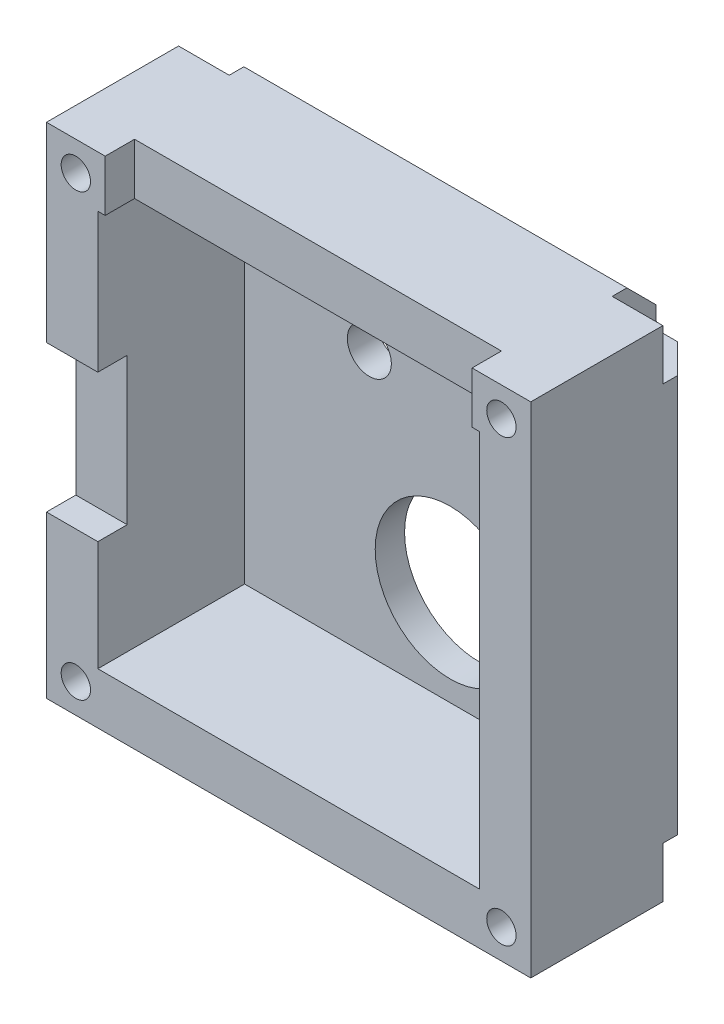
ISO-10303-21;
HEADER;
FILE_DESCRIPTION(('STEP AP214'),'2;1');
FILE_NAME('part.step','',(''),(''),'','','');
FILE_SCHEMA(('AUTOMOTIVE_DESIGN { 1 0 10303 214 1 1 1 1 }'));
ENDSEC;
DATA;
#1=APPLICATION_CONTEXT('core data for automotive mechanical design processes');
#2=APPLICATION_PROTOCOL_DEFINITION('international standard','automotive_design',2000,#1);
#3=PRODUCT_CONTEXT('',#1,'mechanical');
#4=PRODUCT('Part','Part','',(#3));
#5=PRODUCT_RELATED_PRODUCT_CATEGORY('part','',(#4));
#6=PRODUCT_DEFINITION_FORMATION('','',#4);
#7=PRODUCT_DEFINITION_CONTEXT('part definition',#1,'design');
#8=PRODUCT_DEFINITION('design','',#6,#7);
#9=PRODUCT_DEFINITION_SHAPE('','',#8);
#10=(LENGTH_UNIT() NAMED_UNIT(*) SI_UNIT(.MILLI.,.METRE.));
#11=(NAMED_UNIT(*) PLANE_ANGLE_UNIT() SI_UNIT($,.RADIAN.));
#12=(NAMED_UNIT(*) SI_UNIT($,.STERADIAN.) SOLID_ANGLE_UNIT());
#13=UNCERTAINTY_MEASURE_WITH_UNIT(LENGTH_MEASURE(1.E-05),#10,'distance_accuracy_value','');
#14=(GEOMETRIC_REPRESENTATION_CONTEXT(3) GLOBAL_UNCERTAINTY_ASSIGNED_CONTEXT((#13)) GLOBAL_UNIT_ASSIGNED_CONTEXT((#10,
#11,#12)) REPRESENTATION_CONTEXT('',''));
#15=CARTESIAN_POINT('',(0.,0.,0.));
#16=DIRECTION('',(0.,0.,1.));
#17=DIRECTION('',(1.,0.,0.));
#18=AXIS2_PLACEMENT_3D('',#15,#16,#17);
#19=CARTESIAN_POINT('',(0.,0.,10.));
#20=DIRECTION('',(0.,0.,-1.));
#21=DIRECTION('',(-1.,0.,0.));
#22=AXIS2_PLACEMENT_3D('',#19,#20,#21);
#23=PLANE('',#22);
#24=CARTESIAN_POINT('',(14.5,15.,10.));
#25=DIRECTION('',(0.,0.,-1.));
#26=DIRECTION('',(-1.,0.,0.));
#27=AXIS2_PLACEMENT_3D('',#24,#25,#26);
#28=CIRCLE('',#27,0.999999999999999);
#29=CARTESIAN_POINT('',(13.5,15.,10.));
#30=VERTEX_POINT('',#29);
#31=EDGE_CURVE('E457',#30,#30,#28,.T.);
#32=ORIENTED_EDGE('',*,*,#31,.T.);
#33=EDGE_LOOP('',(#32));
#34=FACE_BOUND('',#33,.T.);
#35=CARTESIAN_POINT('',(-14.5,-15.,10.));
#36=DIRECTION('',(0.,0.,-1.));
#37=DIRECTION('',(-1.,0.,0.));
#38=AXIS2_PLACEMENT_3D('',#35,#36,#37);
#39=CIRCLE('',#38,0.999999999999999);
#40=CARTESIAN_POINT('',(-15.5,-15.,10.));
#41=VERTEX_POINT('',#40);
#42=EDGE_CURVE('E466',#41,#41,#39,.T.);
#43=ORIENTED_EDGE('',*,*,#42,.T.);
#44=EDGE_LOOP('',(#43));
#45=FACE_BOUND('',#44,.T.);
#46=CARTESIAN_POINT('',(14.5,-15.,10.));
#47=DIRECTION('',(0.,0.,-1.));
#48=DIRECTION('',(-1.,0.,0.));
#49=AXIS2_PLACEMENT_3D('',#46,#47,#48);
#50=CIRCLE('',#49,0.999999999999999);
#51=CARTESIAN_POINT('',(13.5,-15.,10.));
#52=VERTEX_POINT('',#51);
#53=EDGE_CURVE('E470',#52,#52,#50,.T.);
#54=ORIENTED_EDGE('',*,*,#53,.T.);
#55=EDGE_LOOP('',(#54));
#56=FACE_BOUND('',#55,.T.);
#57=DIRECTION('',(0.,-1.,0.));
#58=VECTOR('',#57,1.);
#59=CARTESIAN_POINT('',(-13.,-13.5,10.));
#60=LINE('',#59,#58);
#61=CARTESIAN_POINT('',(-13.,-6.,10.));
#62=VERTEX_POINT('',#61);
#63=CARTESIAN_POINT('',(-13.,-13.5,10.));
#64=VERTEX_POINT('',#63);
#65=EDGE_CURVE('E484',#62,#64,#60,.T.);
#66=ORIENTED_EDGE('',*,*,#65,.F.);
#67=DIRECTION('',(-1.,0.,0.));
#68=VECTOR('',#67,1.);
#69=CARTESIAN_POINT('',(0.,-6.,10.));
#70=LINE('',#69,#68);
#71=CARTESIAN_POINT('',(-16.5,-6.,10.));
#72=VERTEX_POINT('',#71);
#73=EDGE_CURVE('E313',#62,#72,#70,.T.);
#74=ORIENTED_EDGE('',*,*,#73,.T.);
#75=DIRECTION('',(0.,-1.,0.));
#76=VECTOR('',#75,1.);
#77=CARTESIAN_POINT('',(-16.5,-17.,10.));
#78=LINE('',#77,#76);
#79=CARTESIAN_POINT('',(-16.5,-17.,10.));
#80=VERTEX_POINT('',#79);
#81=EDGE_CURVE('E530',#72,#80,#78,.T.);
#82=ORIENTED_EDGE('',*,*,#81,.T.);
#83=DIRECTION('',(1.,0.,0.));
#84=VECTOR('',#83,1.);
#85=CARTESIAN_POINT('',(-16.5,-17.,10.));
#86=LINE('',#85,#84);
#87=CARTESIAN_POINT('',(16.5,-17.,10.));
#88=VERTEX_POINT('',#87);
#89=EDGE_CURVE('E534',#80,#88,#86,.T.);
#90=ORIENTED_EDGE('',*,*,#89,.T.);
#91=DIRECTION('',(0.,1.,0.));
#92=VECTOR('',#91,1.);
#93=CARTESIAN_POINT('',(16.5,-17.,10.));
#94=LINE('',#93,#92);
#95=CARTESIAN_POINT('',(16.5,17.,10.));
#96=VERTEX_POINT('',#95);
#97=EDGE_CURVE('E521',#88,#96,#94,.T.);
#98=ORIENTED_EDGE('',*,*,#97,.T.);
#99=DIRECTION('',(-1.,0.,0.));
#100=VECTOR('',#99,1.);
#101=CARTESIAN_POINT('',(-16.5,17.,10.));
#102=LINE('',#101,#100);
#103=CARTESIAN_POINT('',(12.5,17.,10.));
#104=VERTEX_POINT('',#103);
#105=EDGE_CURVE('E526',#96,#104,#102,.T.);
#106=ORIENTED_EDGE('',*,*,#105,.T.);
#107=DIRECTION('',(0.,-1.,0.));
#108=VECTOR('',#107,1.);
#109=CARTESIAN_POINT('',(12.5,0.,10.));
#110=LINE('',#109,#108);
#111=CARTESIAN_POINT('',(12.5,13.5,10.));
#112=VERTEX_POINT('',#111);
#113=EDGE_CURVE('E336',#104,#112,#110,.T.);
#114=ORIENTED_EDGE('',*,*,#113,.T.);
#115=DIRECTION('',(-1.,0.,0.));
#116=VECTOR('',#115,1.);
#117=CARTESIAN_POINT('',(-13.,13.5,10.));
#118=LINE('',#117,#116);
#119=CARTESIAN_POINT('',(13.,13.5,10.));
#120=VERTEX_POINT('',#119);
#121=EDGE_CURVE('E480',#120,#112,#118,.T.);
#122=ORIENTED_EDGE('',*,*,#121,.F.);
#123=DIRECTION('',(0.,1.,0.));
#124=VECTOR('',#123,1.);
#125=CARTESIAN_POINT('',(13.,-13.5,10.));
#126=LINE('',#125,#124);
#127=CARTESIAN_POINT('',(13.,-13.5,10.));
#128=VERTEX_POINT('',#127);
#129=EDGE_CURVE('E475',#128,#120,#126,.T.);
#130=ORIENTED_EDGE('',*,*,#129,.F.);
#131=DIRECTION('',(1.,0.,0.));
#132=VECTOR('',#131,1.);
#133=CARTESIAN_POINT('',(-13.,-13.5,10.));
#134=LINE('',#133,#132);
#135=EDGE_CURVE('E489',#64,#128,#134,.T.);
#136=ORIENTED_EDGE('',*,*,#135,.F.);
#137=EDGE_LOOP('',(#66,#74,#82,#90,#98,#106,#114,#122,#130,#136));
#138=FACE_BOUND('',#137,.T.);
#139=ADVANCED_FACE('F47',(#34,#45,#56,#138),#23,.F.);
#140=CARTESIAN_POINT('',(14.5,15.,19.));
#141=DIRECTION('',(0.,0.,-1.));
#142=DIRECTION('',(-1.,0.,0.));
#143=AXIS2_PLACEMENT_3D('',#140,#141,#142);
#144=CYLINDRICAL_SURFACE('',#143,0.999999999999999);
#145=ORIENTED_EDGE('',*,*,#31,.F.);
#146=EDGE_LOOP('',(#145));
#147=FACE_BOUND('',#146,.T.);
#148=CARTESIAN_POINT('',(14.5,15.,1.));
#149=DIRECTION('',(0.,0.,-1.));
#150=DIRECTION('',(-1.,0.,0.));
#151=AXIS2_PLACEMENT_3D('',#148,#149,#150);
#152=CIRCLE('',#151,0.999999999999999);
#153=CARTESIAN_POINT('',(13.5,15.,1.));
#154=VERTEX_POINT('',#153);
#155=EDGE_CURVE('E462',#154,#154,#152,.F.);
#156=ORIENTED_EDGE('',*,*,#155,.F.);
#157=EDGE_LOOP('',(#156));
#158=FACE_BOUND('',#157,.T.);
#159=ADVANCED_FACE('F787',(#147,#158),#144,.F.);
#160=CARTESIAN_POINT('',(-14.5,15.,19.));
#161=DIRECTION('',(0.,0.,-1.));
#162=DIRECTION('',(-1.,0.,0.));
#163=AXIS2_PLACEMENT_3D('',#160,#161,#162);
#164=CYLINDRICAL_SURFACE('',#163,0.999999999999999);
#165=CARTESIAN_POINT('',(-14.5,15.,10.));
#166=DIRECTION('',(0.,0.,-1.));
#167=DIRECTION('',(-1.,0.,0.));
#168=AXIS2_PLACEMENT_3D('',#165,#166,#167);
#169=CIRCLE('',#168,0.999999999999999);
#170=CARTESIAN_POINT('',(-15.5,15.,10.));
#171=VERTEX_POINT('',#170);
#172=EDGE_CURVE('E461',#171,#171,#169,.T.);
#173=ORIENTED_EDGE('',*,*,#172,.F.);
#174=EDGE_LOOP('',(#173));
#175=FACE_BOUND('',#174,.T.);
#176=CARTESIAN_POINT('',(-14.5,15.,1.));
#177=DIRECTION('',(0.,0.,-1.));
#178=DIRECTION('',(-1.,0.,0.));
#179=AXIS2_PLACEMENT_3D('',#176,#177,#178);
#180=CIRCLE('',#179,0.999999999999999);
#181=CARTESIAN_POINT('',(-15.5,15.,1.));
#182=VERTEX_POINT('',#181);
#183=EDGE_CURVE('E561',#182,#182,#180,.F.);
#184=ORIENTED_EDGE('',*,*,#183,.F.);
#185=EDGE_LOOP('',(#184));
#186=FACE_BOUND('',#185,.T.);
#187=ADVANCED_FACE('F795',(#175,#186),#164,.F.);
#188=CARTESIAN_POINT('',(-14.5,-15.,19.));
#189=DIRECTION('',(0.,0.,-1.));
#190=DIRECTION('',(-1.,0.,0.));
#191=AXIS2_PLACEMENT_3D('',#188,#189,#190);
#192=CYLINDRICAL_SURFACE('',#191,0.999999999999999);
#193=ORIENTED_EDGE('',*,*,#42,.F.);
#194=EDGE_LOOP('',(#193));
#195=FACE_BOUND('',#194,.T.);
#196=CARTESIAN_POINT('',(-14.5,-15.,1.));
#197=DIRECTION('',(0.,0.,-1.));
#198=DIRECTION('',(-1.,0.,0.));
#199=AXIS2_PLACEMENT_3D('',#196,#197,#198);
#200=CIRCLE('',#199,0.999999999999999);
#201=CARTESIAN_POINT('',(-15.5,-15.,1.));
#202=VERTEX_POINT('',#201);
#203=EDGE_CURVE('E557',#202,#202,#200,.F.);
#204=ORIENTED_EDGE('',*,*,#203,.F.);
#205=EDGE_LOOP('',(#204));
#206=FACE_BOUND('',#205,.T.);
#207=ADVANCED_FACE('F811',(#195,#206),#192,.F.);
#208=CARTESIAN_POINT('',(14.5,-15.,19.));
#209=DIRECTION('',(0.,0.,-1.));
#210=DIRECTION('',(-1.,0.,0.));
#211=AXIS2_PLACEMENT_3D('',#208,#209,#210);
#212=CYLINDRICAL_SURFACE('',#211,0.999999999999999);
#213=ORIENTED_EDGE('',*,*,#53,.F.);
#214=EDGE_LOOP('',(#213));
#215=FACE_BOUND('',#214,.T.);
#216=CARTESIAN_POINT('',(14.5,-15.,1.));
#217=DIRECTION('',(0.,0.,-1.));
#218=DIRECTION('',(-1.,0.,0.));
#219=AXIS2_PLACEMENT_3D('',#216,#217,#218);
#220=CIRCLE('',#219,0.999999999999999);
#221=CARTESIAN_POINT('',(13.5,-15.,1.));
#222=VERTEX_POINT('',#221);
#223=EDGE_CURVE('E453',#222,#222,#220,.F.);
#224=ORIENTED_EDGE('',*,*,#223,.F.);
#225=EDGE_LOOP('',(#224));
#226=FACE_BOUND('',#225,.T.);
#227=ADVANCED_FACE('F802',(#215,#226),#212,.F.);
#228=ORIENTED_EDGE('',*,*,#172,.T.);
#229=EDGE_LOOP('',(#228));
#230=FACE_BOUND('',#229,.T.);
#231=CARTESIAN_POINT('',(-16.5,17.,10.));
#232=VERTEX_POINT('',#231);
#233=CARTESIAN_POINT('',(-16.5,4.,10.));
#234=VERTEX_POINT('',#233);
#235=EDGE_CURVE('E531',#232,#234,#78,.T.);
#236=ORIENTED_EDGE('',*,*,#235,.T.);
#237=DIRECTION('',(1.,0.,0.));
#238=VECTOR('',#237,1.);
#239=CARTESIAN_POINT('',(0.,4.,10.));
#240=LINE('',#239,#238);
#241=CARTESIAN_POINT('',(-13.,4.,10.));
#242=VERTEX_POINT('',#241);
#243=EDGE_CURVE('E294',#234,#242,#240,.T.);
#244=ORIENTED_EDGE('',*,*,#243,.T.);
#245=CARTESIAN_POINT('',(-13.,13.5,10.));
#246=VERTEX_POINT('',#245);
#247=EDGE_CURVE('E485',#246,#242,#60,.T.);
#248=ORIENTED_EDGE('',*,*,#247,.F.);
#249=CARTESIAN_POINT('',(-12.5,13.5,10.));
#250=VERTEX_POINT('',#249);
#251=EDGE_CURVE('E478',#250,#246,#118,.T.);
#252=ORIENTED_EDGE('',*,*,#251,.F.);
#253=DIRECTION('',(0.,1.,0.));
#254=VECTOR('',#253,1.);
#255=CARTESIAN_POINT('',(-12.5,0.,10.));
#256=LINE('',#255,#254);
#257=CARTESIAN_POINT('',(-12.5,17.,10.));
#258=VERTEX_POINT('',#257);
#259=EDGE_CURVE('E329',#250,#258,#256,.T.);
#260=ORIENTED_EDGE('',*,*,#259,.T.);
#261=EDGE_CURVE('E525',#258,#232,#102,.T.);
#262=ORIENTED_EDGE('',*,*,#261,.T.);
#263=EDGE_LOOP('',(#236,#244,#248,#252,#260,#262));
#264=FACE_BOUND('',#263,.T.);
#265=ADVANCED_FACE('F700',(#230,#264),#23,.F.);
#266=CARTESIAN_POINT('',(16.5,-17.,10.));
#267=DIRECTION('',(-1.,0.,0.));
#268=DIRECTION('',(0.,0.,1.));
#269=AXIS2_PLACEMENT_3D('',#266,#267,#268);
#270=PLANE('',#269);
#271=DIRECTION('',(0.,0.,-1.));
#272=VECTOR('',#271,1.);
#273=CARTESIAN_POINT('',(16.5,-13.55,1.));
#274=LINE('',#273,#272);
#275=CARTESIAN_POINT('',(16.5,-13.55,1.));
#276=VERTEX_POINT('',#275);
#277=CARTESIAN_POINT('',(16.5,-13.55,0.));
#278=VERTEX_POINT('',#277);
#279=EDGE_CURVE('E340',#276,#278,#274,.T.);
#280=ORIENTED_EDGE('',*,*,#279,.T.);
#281=DIRECTION('',(0.,1.,0.));
#282=VECTOR('',#281,1.);
#283=CARTESIAN_POINT('',(16.5,-17.,0.));
#284=LINE('',#283,#282);
#285=CARTESIAN_POINT('',(16.5,13.55,0.));
#286=VERTEX_POINT('',#285);
#287=EDGE_CURVE('E604',#278,#286,#284,.T.);
#288=ORIENTED_EDGE('',*,*,#287,.T.);
#289=DIRECTION('',(0.,0.,-1.));
#290=VECTOR('',#289,1.);
#291=CARTESIAN_POINT('',(16.5,13.55,1.));
#292=LINE('',#291,#290);
#293=CARTESIAN_POINT('',(16.5,13.55,1.));
#294=VERTEX_POINT('',#293);
#295=EDGE_CURVE('E443',#294,#286,#292,.T.);
#296=ORIENTED_EDGE('',*,*,#295,.F.);
#297=DIRECTION('',(0.,-1.,0.));
#298=VECTOR('',#297,1.);
#299=CARTESIAN_POINT('',(16.5,17.,1.));
#300=LINE('',#299,#298);
#301=CARTESIAN_POINT('',(16.5,17.,1.));
#302=VERTEX_POINT('',#301);
#303=EDGE_CURVE('E428',#302,#294,#300,.T.);
#304=ORIENTED_EDGE('',*,*,#303,.F.);
#305=DIRECTION('',(0.,0.,-1.));
#306=VECTOR('',#305,1.);
#307=CARTESIAN_POINT('',(16.5,17.,10.));
#308=LINE('',#307,#306);
#309=EDGE_CURVE('E549',#96,#302,#308,.T.);
#310=ORIENTED_EDGE('',*,*,#309,.F.);
#311=ORIENTED_EDGE('',*,*,#97,.F.);
#312=DIRECTION('',(0.,0.,-1.));
#313=VECTOR('',#312,1.);
#314=CARTESIAN_POINT('',(16.5,-17.,10.));
#315=LINE('',#314,#313);
#316=CARTESIAN_POINT('',(16.5,-17.,1.));
#317=VERTEX_POINT('',#316);
#318=EDGE_CURVE('E537',#88,#317,#315,.T.);
#319=ORIENTED_EDGE('',*,*,#318,.T.);
#320=DIRECTION('',(0.,-1.,0.));
#321=VECTOR('',#320,1.);
#322=CARTESIAN_POINT('',(16.5,-17.,1.));
#323=LINE('',#322,#321);
#324=EDGE_CURVE('E405',#276,#317,#323,.T.);
#325=ORIENTED_EDGE('',*,*,#324,.F.);
#326=EDGE_LOOP('',(#280,#288,#296,#304,#310,#311,#319,#325));
#327=FACE_BOUND('',#326,.T.);
#328=ADVANCED_FACE('F801',(#327),#270,.F.);
#329=CARTESIAN_POINT('',(-16.5,17.,10.));
#330=DIRECTION('',(0.,-1.,0.));
#331=DIRECTION('',(0.,0.,-1.));
#332=AXIS2_PLACEMENT_3D('',#329,#330,#331);
#333=PLANE('',#332);
#334=DIRECTION('',(-1.,0.,0.));
#335=VECTOR('',#334,1.);
#336=CARTESIAN_POINT('',(-12.5,17.,8.));
#337=LINE('',#336,#335);
#338=CARTESIAN_POINT('',(12.5,17.,8.));
#339=VERTEX_POINT('',#338);
#340=CARTESIAN_POINT('',(-12.5,17.,8.));
#341=VERTEX_POINT('',#340);
#342=EDGE_CURVE('E320',#339,#341,#337,.T.);
#343=ORIENTED_EDGE('',*,*,#342,.F.);
#344=DIRECTION('',(0.,0.,-1.));
#345=VECTOR('',#344,1.);
#346=CARTESIAN_POINT('',(12.5,17.,8.));
#347=LINE('',#346,#345);
#348=EDGE_CURVE('E317',#104,#339,#347,.T.);
#349=ORIENTED_EDGE('',*,*,#348,.F.);
#350=ORIENTED_EDGE('',*,*,#105,.F.);
#351=ORIENTED_EDGE('',*,*,#309,.T.);
#352=DIRECTION('',(1.,0.,0.));
#353=VECTOR('',#352,1.);
#354=CARTESIAN_POINT('',(16.5,17.,1.));
#355=LINE('',#354,#353);
#356=CARTESIAN_POINT('',(13.05,17.,1.));
#357=VERTEX_POINT('',#356);
#358=EDGE_CURVE('E440',#357,#302,#355,.T.);
#359=ORIENTED_EDGE('',*,*,#358,.F.);
#360=DIRECTION('',(0.,0.,-1.));
#361=VECTOR('',#360,1.);
#362=CARTESIAN_POINT('',(13.05,17.,1.));
#363=LINE('',#362,#361);
#364=CARTESIAN_POINT('',(13.05,17.,0.));
#365=VERTEX_POINT('',#364);
#366=EDGE_CURVE('E449',#357,#365,#363,.T.);
#367=ORIENTED_EDGE('',*,*,#366,.T.);
#368=DIRECTION('',(-1.,0.,0.));
#369=VECTOR('',#368,1.);
#370=CARTESIAN_POINT('',(-16.5,17.,0.));
#371=LINE('',#370,#369);
#372=CARTESIAN_POINT('',(-13.05,17.,0.));
#373=VERTEX_POINT('',#372);
#374=EDGE_CURVE('E613',#365,#373,#371,.T.);
#375=ORIENTED_EDGE('',*,*,#374,.T.);
#376=DIRECTION('',(0.,0.,-1.));
#377=VECTOR('',#376,1.);
#378=CARTESIAN_POINT('',(-13.05,17.,1.));
#379=LINE('',#378,#377);
#380=CARTESIAN_POINT('',(-13.05,17.,1.));
#381=VERTEX_POINT('',#380);
#382=EDGE_CURVE('E341',#381,#373,#379,.T.);
#383=ORIENTED_EDGE('',*,*,#382,.F.);
#384=DIRECTION('',(1.,0.,0.));
#385=VECTOR('',#384,1.);
#386=CARTESIAN_POINT('',(-16.5,17.,1.));
#387=LINE('',#386,#385);
#388=CARTESIAN_POINT('',(-16.5,17.,1.));
#389=VERTEX_POINT('',#388);
#390=EDGE_CURVE('E355',#389,#381,#387,.T.);
#391=ORIENTED_EDGE('',*,*,#390,.F.);
#392=DIRECTION('',(0.,0.,-1.));
#393=VECTOR('',#392,1.);
#394=CARTESIAN_POINT('',(-16.5,17.,10.));
#395=LINE('',#394,#393);
#396=EDGE_CURVE('E545',#232,#389,#395,.T.);
#397=ORIENTED_EDGE('',*,*,#396,.F.);
#398=ORIENTED_EDGE('',*,*,#261,.F.);
#399=DIRECTION('',(0.,0.,1.));
#400=VECTOR('',#399,1.);
#401=CARTESIAN_POINT('',(-12.5,17.,8.));
#402=LINE('',#401,#400);
#403=EDGE_CURVE('E323',#341,#258,#402,.T.);
#404=ORIENTED_EDGE('',*,*,#403,.F.);
#405=EDGE_LOOP('',(#343,#349,#350,#351,#359,#367,#375,#383,#391,#397,#398,#404));
#406=FACE_BOUND('',#405,.T.);
#407=ADVANCED_FACE('F707',(#406),#333,.F.);
#408=CARTESIAN_POINT('',(-16.5,-17.,10.));
#409=DIRECTION('',(1.,0.,0.));
#410=DIRECTION('',(0.,0.,-1.));
#411=AXIS2_PLACEMENT_3D('',#408,#409,#410);
#412=PLANE('',#411);
#413=ORIENTED_EDGE('',*,*,#81,.F.);
#414=DIRECTION('',(0.,0.,1.));
#415=VECTOR('',#414,1.);
#416=CARTESIAN_POINT('',(-16.5,-6.,8.));
#417=LINE('',#416,#415);
#418=CARTESIAN_POINT('',(-16.5,-6.,8.));
#419=VERTEX_POINT('',#418);
#420=EDGE_CURVE('E288',#419,#72,#417,.T.);
#421=ORIENTED_EDGE('',*,*,#420,.F.);
#422=DIRECTION('',(0.,-1.,0.));
#423=VECTOR('',#422,1.);
#424=CARTESIAN_POINT('',(-16.5,4.,8.));
#425=LINE('',#424,#423);
#426=CARTESIAN_POINT('',(-16.5,4.,8.));
#427=VERTEX_POINT('',#426);
#428=EDGE_CURVE('E282',#427,#419,#425,.T.);
#429=ORIENTED_EDGE('',*,*,#428,.F.);
#430=DIRECTION('',(0.,0.,-1.));
#431=VECTOR('',#430,1.);
#432=CARTESIAN_POINT('',(-16.5,4.,8.));
#433=LINE('',#432,#431);
#434=EDGE_CURVE('E291',#234,#427,#433,.T.);
#435=ORIENTED_EDGE('',*,*,#434,.F.);
#436=ORIENTED_EDGE('',*,*,#235,.F.);
#437=ORIENTED_EDGE('',*,*,#396,.T.);
#438=DIRECTION('',(0.,1.,0.));
#439=VECTOR('',#438,1.);
#440=CARTESIAN_POINT('',(-16.5,17.,1.));
#441=LINE('',#440,#439);
#442=CARTESIAN_POINT('',(-16.5,13.55,1.));
#443=VERTEX_POINT('',#442);
#444=EDGE_CURVE('E345',#443,#389,#441,.T.);
#445=ORIENTED_EDGE('',*,*,#444,.F.);
#446=DIRECTION('',(0.,0.,-1.));
#447=VECTOR('',#446,1.);
#448=CARTESIAN_POINT('',(-16.5,13.55,1.));
#449=LINE('',#448,#447);
#450=CARTESIAN_POINT('',(-16.5,13.55,0.));
#451=VERTEX_POINT('',#450);
#452=EDGE_CURVE('E346',#443,#451,#449,.T.);
#453=ORIENTED_EDGE('',*,*,#452,.T.);
#454=DIRECTION('',(0.,-1.,0.));
#455=VECTOR('',#454,1.);
#456=CARTESIAN_POINT('',(-16.5,-17.,0.));
#457=LINE('',#456,#455);
#458=CARTESIAN_POINT('',(-16.5,-13.55,0.));
#459=VERTEX_POINT('',#458);
#460=EDGE_CURVE('E586',#451,#459,#457,.T.);
#461=ORIENTED_EDGE('',*,*,#460,.T.);
#462=DIRECTION('',(0.,0.,-1.));
#463=VECTOR('',#462,1.);
#464=CARTESIAN_POINT('',(-16.5,-13.55,1.));
#465=LINE('',#464,#463);
#466=CARTESIAN_POINT('',(-16.5,-13.55,1.));
#467=VERTEX_POINT('',#466);
#468=EDGE_CURVE('E372',#467,#459,#465,.T.);
#469=ORIENTED_EDGE('',*,*,#468,.F.);
#470=DIRECTION('',(0.,1.,0.));
#471=VECTOR('',#470,1.);
#472=CARTESIAN_POINT('',(-16.5,-17.,1.));
#473=LINE('',#472,#471);
#474=CARTESIAN_POINT('',(-16.5,-17.,1.));
#475=VERTEX_POINT('',#474);
#476=EDGE_CURVE('E385',#475,#467,#473,.T.);
#477=ORIENTED_EDGE('',*,*,#476,.F.);
#478=DIRECTION('',(0.,0.,-1.));
#479=VECTOR('',#478,1.);
#480=CARTESIAN_POINT('',(-16.5,-17.,10.));
#481=LINE('',#480,#479);
#482=EDGE_CURVE('E541',#80,#475,#481,.T.);
#483=ORIENTED_EDGE('',*,*,#482,.F.);
#484=EDGE_LOOP('',(#413,#421,#429,#435,#436,#437,#445,#453,#461,#469,#477,#483));
#485=FACE_BOUND('',#484,.T.);
#486=ADVANCED_FACE('F302',(#485),#412,.F.);
#487=CARTESIAN_POINT('',(-16.5,-17.,10.));
#488=DIRECTION('',(0.,1.,0.));
#489=DIRECTION('',(0.,0.,1.));
#490=AXIS2_PLACEMENT_3D('',#487,#488,#489);
#491=PLANE('',#490);
#492=DIRECTION('',(0.,0.,-1.));
#493=VECTOR('',#492,1.);
#494=CARTESIAN_POINT('',(-13.05,-17.,1.));
#495=LINE('',#494,#493);
#496=CARTESIAN_POINT('',(-13.05,-17.,1.));
#497=VERTEX_POINT('',#496);
#498=CARTESIAN_POINT('',(-13.05,-17.,0.));
#499=VERTEX_POINT('',#498);
#500=EDGE_CURVE('E377',#497,#499,#495,.T.);
#501=ORIENTED_EDGE('',*,*,#500,.T.);
#502=DIRECTION('',(1.,0.,0.));
#503=VECTOR('',#502,1.);
#504=CARTESIAN_POINT('',(-16.5,-17.,0.));
#505=LINE('',#504,#503);
#506=CARTESIAN_POINT('',(13.05,-17.,0.));
#507=VERTEX_POINT('',#506);
#508=EDGE_CURVE('E595',#499,#507,#505,.T.);
#509=ORIENTED_EDGE('',*,*,#508,.T.);
#510=DIRECTION('',(0.,0.,-1.));
#511=VECTOR('',#510,1.);
#512=CARTESIAN_POINT('',(13.05,-17.,1.));
#513=LINE('',#512,#511);
#514=CARTESIAN_POINT('',(13.05,-17.,1.));
#515=VERTEX_POINT('',#514);
#516=EDGE_CURVE('E401',#515,#507,#513,.T.);
#517=ORIENTED_EDGE('',*,*,#516,.F.);
#518=DIRECTION('',(-1.,0.,0.));
#519=VECTOR('',#518,1.);
#520=CARTESIAN_POINT('',(16.5,-17.,1.));
#521=LINE('',#520,#519);
#522=EDGE_CURVE('E412',#317,#515,#521,.T.);
#523=ORIENTED_EDGE('',*,*,#522,.F.);
#524=ORIENTED_EDGE('',*,*,#318,.F.);
#525=ORIENTED_EDGE('',*,*,#89,.F.);
#526=ORIENTED_EDGE('',*,*,#482,.T.);
#527=DIRECTION('',(-1.,0.,0.));
#528=VECTOR('',#527,1.);
#529=CARTESIAN_POINT('',(-16.5,-17.,1.));
#530=LINE('',#529,#528);
#531=EDGE_CURVE('E376',#497,#475,#530,.T.);
#532=ORIENTED_EDGE('',*,*,#531,.F.);
#533=EDGE_LOOP('',(#501,#509,#517,#523,#524,#525,#526,#532));
#534=FACE_BOUND('',#533,.T.);
#535=ADVANCED_FACE('F751',(#534),#491,.F.);
#536=CARTESIAN_POINT('',(13.,-13.5,10.));
#537=DIRECTION('',(-1.,0.,0.));
#538=DIRECTION('',(0.,0.,1.));
#539=AXIS2_PLACEMENT_3D('',#536,#537,#538);
#540=PLANE('',#539);
#541=DIRECTION('',(0.,1.,0.));
#542=VECTOR('',#541,1.);
#543=CARTESIAN_POINT('',(13.,-13.5,0.));
#544=LINE('',#543,#542);
#545=CARTESIAN_POINT('',(13.,-13.5,0.));
#546=VERTEX_POINT('',#545);
#547=CARTESIAN_POINT('',(13.,13.5,0.));
#548=VERTEX_POINT('',#547);
#549=EDGE_CURVE('E474',#546,#548,#544,.T.);
#550=ORIENTED_EDGE('',*,*,#549,.F.);
#551=DIRECTION('',(0.,0.,-1.));
#552=VECTOR('',#551,1.);
#553=CARTESIAN_POINT('',(13.,-13.5,10.));
#554=LINE('',#553,#552);
#555=EDGE_CURVE('E492',#128,#546,#554,.T.);
#556=ORIENTED_EDGE('',*,*,#555,.F.);
#557=ORIENTED_EDGE('',*,*,#129,.T.);
#558=DIRECTION('',(0.,0.,-1.));
#559=VECTOR('',#558,1.);
#560=CARTESIAN_POINT('',(13.,13.5,10.));
#561=LINE('',#560,#559);
#562=EDGE_CURVE('E517',#120,#548,#561,.T.);
#563=ORIENTED_EDGE('',*,*,#562,.T.);
#564=EDGE_LOOP('',(#550,#556,#557,#563));
#565=FACE_BOUND('',#564,.T.);
#566=ADVANCED_FACE('F769',(#565),#540,.T.);
#567=CARTESIAN_POINT('',(-13.,13.5,10.));
#568=DIRECTION('',(0.,-1.,0.));
#569=DIRECTION('',(0.,0.,-1.));
#570=AXIS2_PLACEMENT_3D('',#567,#568,#569);
#571=PLANE('',#570);
#572=DIRECTION('',(0.,0.,1.));
#573=VECTOR('',#572,1.);
#574=CARTESIAN_POINT('',(12.5,13.5,10.));
#575=LINE('',#574,#573);
#576=CARTESIAN_POINT('',(12.5,13.5,8.));
#577=VERTEX_POINT('',#576);
#578=EDGE_CURVE('E677',#577,#112,#575,.T.);
#579=ORIENTED_EDGE('',*,*,#578,.F.);
#580=DIRECTION('',(1.,0.,0.));
#581=VECTOR('',#580,1.);
#582=CARTESIAN_POINT('',(-13.,13.5,8.));
#583=LINE('',#582,#581);
#584=CARTESIAN_POINT('',(-12.5,13.5,8.));
#585=VERTEX_POINT('',#584);
#586=EDGE_CURVE('E671',#585,#577,#583,.T.);
#587=ORIENTED_EDGE('',*,*,#586,.F.);
#588=DIRECTION('',(0.,0.,-1.));
#589=VECTOR('',#588,1.);
#590=CARTESIAN_POINT('',(-12.5,13.5,10.));
#591=LINE('',#590,#589);
#592=EDGE_CURVE('E674',#250,#585,#591,.T.);
#593=ORIENTED_EDGE('',*,*,#592,.F.);
#594=ORIENTED_EDGE('',*,*,#251,.T.);
#595=DIRECTION('',(0.,0.,-1.));
#596=VECTOR('',#595,1.);
#597=CARTESIAN_POINT('',(-13.,13.5,10.));
#598=LINE('',#597,#596);
#599=CARTESIAN_POINT('',(-13.,13.5,0.));
#600=VERTEX_POINT('',#599);
#601=EDGE_CURVE('E514',#246,#600,#598,.T.);
#602=ORIENTED_EDGE('',*,*,#601,.T.);
#603=DIRECTION('',(-1.,0.,0.));
#604=VECTOR('',#603,1.);
#605=CARTESIAN_POINT('',(-13.,13.5,0.));
#606=LINE('',#605,#604);
#607=EDGE_CURVE('E496',#548,#600,#606,.T.);
#608=ORIENTED_EDGE('',*,*,#607,.F.);
#609=ORIENTED_EDGE('',*,*,#562,.F.);
#610=ORIENTED_EDGE('',*,*,#121,.T.);
#611=EDGE_LOOP('',(#579,#587,#593,#594,#602,#608,#609,#610));
#612=FACE_BOUND('',#611,.T.);
#613=ADVANCED_FACE('F692',(#612),#571,.T.);
#614=CARTESIAN_POINT('',(-13.,-13.5,10.));
#615=DIRECTION('',(1.,0.,0.));
#616=DIRECTION('',(0.,0.,-1.));
#617=AXIS2_PLACEMENT_3D('',#614,#615,#616);
#618=PLANE('',#617);
#619=DIRECTION('',(0.,0.,-1.));
#620=VECTOR('',#619,1.);
#621=CARTESIAN_POINT('',(-13.,-6.,10.));
#622=LINE('',#621,#620);
#623=CARTESIAN_POINT('',(-13.,-6.,8.));
#624=VERTEX_POINT('',#623);
#625=EDGE_CURVE('E11',#62,#624,#622,.T.);
#626=ORIENTED_EDGE('',*,*,#625,.F.);
#627=ORIENTED_EDGE('',*,*,#65,.T.);
#628=DIRECTION('',(0.,0.,-1.));
#629=VECTOR('',#628,1.);
#630=CARTESIAN_POINT('',(-13.,-13.5,10.));
#631=LINE('',#630,#629);
#632=CARTESIAN_POINT('',(-13.,-13.5,0.));
#633=VERTEX_POINT('',#632);
#634=EDGE_CURVE('E510',#64,#633,#631,.T.);
#635=ORIENTED_EDGE('',*,*,#634,.T.);
#636=DIRECTION('',(0.,-1.,0.));
#637=VECTOR('',#636,1.);
#638=CARTESIAN_POINT('',(-13.,-13.5,0.));
#639=LINE('',#638,#637);
#640=EDGE_CURVE('E500',#600,#633,#639,.T.);
#641=ORIENTED_EDGE('',*,*,#640,.F.);
#642=ORIENTED_EDGE('',*,*,#601,.F.);
#643=ORIENTED_EDGE('',*,*,#247,.T.);
#644=DIRECTION('',(0.,0.,1.));
#645=VECTOR('',#644,1.);
#646=CARTESIAN_POINT('',(-13.,4.,10.));
#647=LINE('',#646,#645);
#648=CARTESIAN_POINT('',(-13.,4.,8.));
#649=VERTEX_POINT('',#648);
#650=EDGE_CURVE('E680',#649,#242,#647,.T.);
#651=ORIENTED_EDGE('',*,*,#650,.F.);
#652=DIRECTION('',(0.,1.,0.));
#653=VECTOR('',#652,1.);
#654=CARTESIAN_POINT('',(-13.,-13.5,8.));
#655=LINE('',#654,#653);
#656=EDGE_CURVE('E56',#624,#649,#655,.T.);
#657=ORIENTED_EDGE('',*,*,#656,.F.);
#658=EDGE_LOOP('',(#626,#627,#635,#641,#642,#643,#651,#657));
#659=FACE_BOUND('',#658,.T.);
#660=ADVANCED_FACE('F699',(#659),#618,.T.);
#661=CARTESIAN_POINT('',(-13.,-13.5,10.));
#662=DIRECTION('',(0.,1.,0.));
#663=DIRECTION('',(0.,0.,1.));
#664=AXIS2_PLACEMENT_3D('',#661,#662,#663);
#665=PLANE('',#664);
#666=DIRECTION('',(1.,0.,0.));
#667=VECTOR('',#666,1.);
#668=CARTESIAN_POINT('',(-13.,-13.5,0.));
#669=LINE('',#668,#667);
#670=EDGE_CURVE('E479',#633,#546,#669,.T.);
#671=ORIENTED_EDGE('',*,*,#670,.F.);
#672=ORIENTED_EDGE('',*,*,#634,.F.);
#673=ORIENTED_EDGE('',*,*,#135,.T.);
#674=ORIENTED_EDGE('',*,*,#555,.T.);
#675=EDGE_LOOP('',(#671,#672,#673,#674));
#676=FACE_BOUND('',#675,.T.);
#677=ADVANCED_FACE('F763',(#676),#665,.T.);
#678=CARTESIAN_POINT('',(0.,0.,0.));
#679=DIRECTION('',(0.,0.,1.));
#680=DIRECTION('',(1.,0.,0.));
#681=AXIS2_PLACEMENT_3D('',#678,#679,#680);
#682=PLANE('',#681);
#683=CARTESIAN_POINT('',(1.,-7.00000000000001,0.));
#684=DIRECTION('',(0.,0.,1.));
#685=DIRECTION('',(1.,0.,0.));
#686=AXIS2_PLACEMENT_3D('',#683,#684,#685);
#687=CIRCLE('',#686,5.1);
#688=CARTESIAN_POINT('',(6.1,-7.00000000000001,0.));
#689=VERTEX_POINT('',#688);
#690=EDGE_CURVE('E299',#689,#689,#687,.T.);
#691=ORIENTED_EDGE('',*,*,#690,.F.);
#692=EDGE_LOOP('',(#691));
#693=FACE_BOUND('',#692,.T.);
#694=CARTESIAN_POINT('',(10.5,5.5,0.));
#695=DIRECTION('',(0.,0.,1.));
#696=DIRECTION('',(1.,0.,0.));
#697=AXIS2_PLACEMENT_3D('',#694,#695,#696);
#698=CIRCLE('',#697,1.5);
#699=CARTESIAN_POINT('',(12.,5.5,0.));
#700=VERTEX_POINT('',#699);
#701=EDGE_CURVE('E1145',#700,#700,#698,.T.);
#702=ORIENTED_EDGE('',*,*,#701,.F.);
#703=EDGE_LOOP('',(#702));
#704=FACE_BOUND('',#703,.T.);
#705=CARTESIAN_POINT('',(-4.5,4.49999999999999,0.));
#706=DIRECTION('',(0.,0.,1.));
#707=DIRECTION('',(1.,0.,0.));
#708=AXIS2_PLACEMENT_3D('',#705,#706,#707);
#709=CIRCLE('',#708,1.5);
#710=CARTESIAN_POINT('',(-3.,4.49999999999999,0.));
#711=VERTEX_POINT('',#710);
#712=EDGE_CURVE('E1141',#711,#711,#709,.T.);
#713=ORIENTED_EDGE('',*,*,#712,.F.);
#714=EDGE_LOOP('',(#713));
#715=FACE_BOUND('',#714,.T.);
#716=ORIENTED_EDGE('',*,*,#640,.T.);
#717=ORIENTED_EDGE('',*,*,#670,.T.);
#718=ORIENTED_EDGE('',*,*,#549,.T.);
#719=ORIENTED_EDGE('',*,*,#607,.T.);
#720=EDGE_LOOP('',(#716,#717,#718,#719));
#721=FACE_BOUND('',#720,.T.);
#722=ADVANCED_FACE('F771',(#693,#704,#715,#721),#682,.T.);
#723=CARTESIAN_POINT('',(0.,0.,-2.));
#724=DIRECTION('',(0.,0.,1.));
#725=DIRECTION('',(1.,0.,0.));
#726=AXIS2_PLACEMENT_3D('',#723,#724,#725);
#727=PLANE('',#726);
#728=CARTESIAN_POINT('',(1.,-7.00000000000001,-2.));
#729=DIRECTION('',(0.,0.,-1.));
#730=DIRECTION('',(-1.,0.,0.));
#731=AXIS2_PLACEMENT_3D('',#728,#729,#730);
#732=CIRCLE('',#731,5.1);
#733=CARTESIAN_POINT('',(-4.1,-7.00000000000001,-2.));
#734=VERTEX_POINT('',#733);
#735=EDGE_CURVE('E1129',#734,#734,#732,.T.);
#736=ORIENTED_EDGE('',*,*,#735,.F.);
#737=EDGE_LOOP('',(#736));
#738=FACE_BOUND('',#737,.T.);
#739=CARTESIAN_POINT('',(10.5,5.5,-2.));
#740=DIRECTION('',(0.,0.,-1.));
#741=DIRECTION('',(-1.,0.,0.));
#742=AXIS2_PLACEMENT_3D('',#739,#740,#741);
#743=CIRCLE('',#742,1.5);
#744=CARTESIAN_POINT('',(9.,5.5,-2.));
#745=VERTEX_POINT('',#744);
#746=EDGE_CURVE('E1131',#745,#745,#743,.T.);
#747=ORIENTED_EDGE('',*,*,#746,.F.);
#748=EDGE_LOOP('',(#747));
#749=FACE_BOUND('',#748,.T.);
#750=CARTESIAN_POINT('',(-4.5,4.49999999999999,-2.));
#751=DIRECTION('',(0.,0.,-1.));
#752=DIRECTION('',(-1.,0.,0.));
#753=AXIS2_PLACEMENT_3D('',#750,#751,#752);
#754=CIRCLE('',#753,1.5);
#755=CARTESIAN_POINT('',(-6.,4.49999999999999,-2.));
#756=VERTEX_POINT('',#755);
#757=EDGE_CURVE('E1135',#756,#756,#754,.T.);
#758=ORIENTED_EDGE('',*,*,#757,.F.);
#759=EDGE_LOOP('',(#758));
#760=FACE_BOUND('',#759,.T.);
#761=DIRECTION('',(1.,0.,0.));
#762=VECTOR('',#761,1.);
#763=CARTESIAN_POINT('',(-16.5,-13.55,-2.));
#764=LINE('',#763,#762);
#765=CARTESIAN_POINT('',(-14.5,-13.55,-2.));
#766=VERTEX_POINT('',#765);
#767=CARTESIAN_POINT('',(-13.55,-13.55,-2.));
#768=VERTEX_POINT('',#767);
#769=EDGE_CURVE('E350',#766,#768,#764,.T.);
#770=ORIENTED_EDGE('',*,*,#769,.F.);
#771=DIRECTION('',(0.,1.,0.));
#772=VECTOR('',#771,1.);
#773=CARTESIAN_POINT('',(-14.5,0.,-2.));
#774=LINE('',#773,#772);
#775=CARTESIAN_POINT('',(-14.5,13.55,-2.));
#776=VERTEX_POINT('',#775);
#777=EDGE_CURVE('E579',#766,#776,#774,.T.);
#778=ORIENTED_EDGE('',*,*,#777,.T.);
#779=DIRECTION('',(-1.,0.,0.));
#780=VECTOR('',#779,1.);
#781=CARTESIAN_POINT('',(-16.5,13.55,-2.));
#782=LINE('',#781,#780);
#783=CARTESIAN_POINT('',(-13.55,13.55,-2.));
#784=VERTEX_POINT('',#783);
#785=EDGE_CURVE('E351',#784,#776,#782,.T.);
#786=ORIENTED_EDGE('',*,*,#785,.F.);
#787=CARTESIAN_POINT('',(-13.55,14.05,-2.));
#788=DIRECTION('',(0.,0.,1.));
#789=DIRECTION('',(1.,0.,0.));
#790=AXIS2_PLACEMENT_3D('',#787,#788,#789);
#791=CIRCLE('',#790,0.5);
#792=CARTESIAN_POINT('',(-13.05,14.05,-2.));
#793=VERTEX_POINT('',#792);
#794=EDGE_CURVE('E659',#784,#793,#791,.T.);
#795=ORIENTED_EDGE('',*,*,#794,.T.);
#796=DIRECTION('',(0.,-1.,0.));
#797=VECTOR('',#796,1.);
#798=CARTESIAN_POINT('',(-13.05,17.,-2.));
#799=LINE('',#798,#797);
#800=CARTESIAN_POINT('',(-13.05,15.,-2.));
#801=VERTEX_POINT('',#800);
#802=EDGE_CURVE('E354',#801,#793,#799,.T.);
#803=ORIENTED_EDGE('',*,*,#802,.F.);
#804=DIRECTION('',(1.,0.,0.));
#805=VECTOR('',#804,1.);
#806=CARTESIAN_POINT('',(0.,15.,-2.));
#807=LINE('',#806,#805);
#808=CARTESIAN_POINT('',(13.05,15.,-2.));
#809=VERTEX_POINT('',#808);
#810=EDGE_CURVE('E553',#801,#809,#807,.T.);
#811=ORIENTED_EDGE('',*,*,#810,.T.);
#812=DIRECTION('',(0.,1.,0.));
#813=VECTOR('',#812,1.);
#814=CARTESIAN_POINT('',(13.05,17.,-2.));
#815=LINE('',#814,#813);
#816=CARTESIAN_POINT('',(13.05,14.05,-2.));
#817=VERTEX_POINT('',#816);
#818=EDGE_CURVE('E433',#817,#809,#815,.T.);
#819=ORIENTED_EDGE('',*,*,#818,.F.);
#820=CARTESIAN_POINT('',(13.55,14.05,-2.));
#821=DIRECTION('',(0.,0.,1.));
#822=DIRECTION('',(1.,0.,0.));
#823=AXIS2_PLACEMENT_3D('',#820,#821,#822);
#824=CIRCLE('',#823,0.5);
#825=CARTESIAN_POINT('',(13.55,13.55,-2.));
#826=VERTEX_POINT('',#825);
#827=EDGE_CURVE('E668',#817,#826,#824,.T.);
#828=ORIENTED_EDGE('',*,*,#827,.T.);
#829=DIRECTION('',(-1.,0.,0.));
#830=VECTOR('',#829,1.);
#831=CARTESIAN_POINT('',(16.5,13.55,-2.));
#832=LINE('',#831,#830);
#833=CARTESIAN_POINT('',(14.5,13.55,-2.));
#834=VERTEX_POINT('',#833);
#835=EDGE_CURVE('E359',#834,#826,#832,.T.);
#836=ORIENTED_EDGE('',*,*,#835,.F.);
#837=DIRECTION('',(0.,-1.,0.));
#838=VECTOR('',#837,1.);
#839=CARTESIAN_POINT('',(14.5,0.,-2.));
#840=LINE('',#839,#838);
#841=CARTESIAN_POINT('',(14.5,-13.55,-2.));
#842=VERTEX_POINT('',#841);
#843=EDGE_CURVE('E571',#834,#842,#840,.T.);
#844=ORIENTED_EDGE('',*,*,#843,.T.);
#845=DIRECTION('',(1.,0.,0.));
#846=VECTOR('',#845,1.);
#847=CARTESIAN_POINT('',(16.5,-13.55,-2.));
#848=LINE('',#847,#846);
#849=CARTESIAN_POINT('',(13.55,-13.55,-2.));
#850=VERTEX_POINT('',#849);
#851=EDGE_CURVE('E409',#850,#842,#848,.T.);
#852=ORIENTED_EDGE('',*,*,#851,.F.);
#853=CARTESIAN_POINT('',(13.55,-14.05,-2.));
#854=DIRECTION('',(0.,0.,1.));
#855=DIRECTION('',(1.,0.,0.));
#856=AXIS2_PLACEMENT_3D('',#853,#854,#855);
#857=CIRCLE('',#856,0.5);
#858=CARTESIAN_POINT('',(13.05,-14.05,-2.));
#859=VERTEX_POINT('',#858);
#860=EDGE_CURVE('E665',#850,#859,#857,.T.);
#861=ORIENTED_EDGE('',*,*,#860,.T.);
#862=DIRECTION('',(0.,1.,0.));
#863=VECTOR('',#862,1.);
#864=CARTESIAN_POINT('',(13.05,-17.,-2.));
#865=LINE('',#864,#863);
#866=CARTESIAN_POINT('',(13.05,-15.,-2.));
#867=VERTEX_POINT('',#866);
#868=EDGE_CURVE('E381',#867,#859,#865,.T.);
#869=ORIENTED_EDGE('',*,*,#868,.F.);
#870=DIRECTION('',(-1.,0.,0.));
#871=VECTOR('',#870,1.);
#872=CARTESIAN_POINT('',(0.,-15.,-2.));
#873=LINE('',#872,#871);
#874=CARTESIAN_POINT('',(-13.05,-15.,-2.));
#875=VERTEX_POINT('',#874);
#876=EDGE_CURVE('E575',#867,#875,#873,.T.);
#877=ORIENTED_EDGE('',*,*,#876,.T.);
#878=DIRECTION('',(0.,-1.,0.));
#879=VECTOR('',#878,1.);
#880=CARTESIAN_POINT('',(-13.05,-17.,-2.));
#881=LINE('',#880,#879);
#882=CARTESIAN_POINT('',(-13.05,-14.05,-2.));
#883=VERTEX_POINT('',#882);
#884=EDGE_CURVE('E382',#883,#875,#881,.T.);
#885=ORIENTED_EDGE('',*,*,#884,.F.);
#886=CARTESIAN_POINT('',(-13.55,-14.05,-2.));
#887=DIRECTION('',(0.,0.,1.));
#888=DIRECTION('',(1.,0.,0.));
#889=AXIS2_PLACEMENT_3D('',#886,#887,#888);
#890=CIRCLE('',#889,0.5);
#891=EDGE_CURVE('E662',#883,#768,#890,.T.);
#892=ORIENTED_EDGE('',*,*,#891,.T.);
#893=EDGE_LOOP('',(#770,#778,#786,#795,#803,#811,#819,#828,#836,#844,#852,#861,#869,#877,#885,#892));
#894=FACE_BOUND('',#893,.T.);
#895=ADVANCED_FACE('F731',(#738,#749,#760,#894),#727,.F.);
#896=CARTESIAN_POINT('',(0.,0.,1.));
#897=DIRECTION('',(0.,0.,-1.));
#898=DIRECTION('',(-1.,0.,0.));
#899=AXIS2_PLACEMENT_3D('',#896,#897,#898);
#900=PLANE('',#899);
#901=DIRECTION('',(0.,1.,0.));
#902=VECTOR('',#901,1.);
#903=CARTESIAN_POINT('',(13.05,-17.,1.));
#904=LINE('',#903,#902);
#905=CARTESIAN_POINT('',(13.05,-14.05,1.));
#906=VERTEX_POINT('',#905);
#907=EDGE_CURVE('E421',#515,#906,#904,.T.);
#908=ORIENTED_EDGE('',*,*,#907,.T.);
#909=CARTESIAN_POINT('',(13.55,-14.05,1.));
#910=DIRECTION('',(0.,0.,-1.));
#911=DIRECTION('',(-1.,0.,0.));
#912=AXIS2_PLACEMENT_3D('',#909,#910,#911);
#913=CIRCLE('',#912,0.5);
#914=CARTESIAN_POINT('',(13.55,-13.55,1.));
#915=VERTEX_POINT('',#914);
#916=EDGE_CURVE('E646',#906,#915,#913,.T.);
#917=ORIENTED_EDGE('',*,*,#916,.T.);
#918=DIRECTION('',(1.,0.,0.));
#919=VECTOR('',#918,1.);
#920=CARTESIAN_POINT('',(16.5,-13.55,1.));
#921=LINE('',#920,#919);
#922=EDGE_CURVE('E418',#915,#276,#921,.T.);
#923=ORIENTED_EDGE('',*,*,#922,.T.);
#924=ORIENTED_EDGE('',*,*,#324,.T.);
#925=ORIENTED_EDGE('',*,*,#522,.T.);
#926=EDGE_LOOP('',(#908,#917,#923,#924,#925));
#927=FACE_BOUND('',#926,.T.);
#928=ORIENTED_EDGE('',*,*,#223,.T.);
#929=EDGE_LOOP('',(#928));
#930=FACE_BOUND('',#929,.T.);
#931=ADVANCED_FACE('F779',(#927,#930),#900,.T.);
#932=CARTESIAN_POINT('',(16.5,-13.55,1.));
#933=DIRECTION('',(0.,1.,0.));
#934=DIRECTION('',(0.,0.,1.));
#935=AXIS2_PLACEMENT_3D('',#932,#933,#934);
#936=PLANE('',#935);
#937=ORIENTED_EDGE('',*,*,#922,.F.);
#938=DIRECTION('',(0.,0.,-1.));
#939=VECTOR('',#938,1.);
#940=CARTESIAN_POINT('',(13.55,-13.55,-2.));
#941=LINE('',#940,#939);
#942=EDGE_CURVE('E639',#915,#850,#941,.T.);
#943=ORIENTED_EDGE('',*,*,#942,.T.);
#944=ORIENTED_EDGE('',*,*,#851,.T.);
#945=DIRECTION('',(-0.707106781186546,0.,-0.707106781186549));
#946=VECTOR('',#945,1.);
#947=CARTESIAN_POINT('',(14.5,-13.55,-2.));
#948=LINE('',#947,#946);
#949=EDGE_CURVE('E601',#842,#278,#948,.F.);
#950=ORIENTED_EDGE('',*,*,#949,.T.);
#951=ORIENTED_EDGE('',*,*,#279,.F.);
#952=EDGE_LOOP('',(#937,#943,#944,#950,#951));
#953=FACE_BOUND('',#952,.T.);
#954=ADVANCED_FACE('F838',(#953),#936,.F.);
#955=CARTESIAN_POINT('',(13.05,-17.,1.));
#956=DIRECTION('',(-1.,0.,0.));
#957=DIRECTION('',(0.,0.,1.));
#958=AXIS2_PLACEMENT_3D('',#955,#956,#957);
#959=PLANE('',#958);
#960=ORIENTED_EDGE('',*,*,#868,.T.);
#961=DIRECTION('',(0.,0.,-1.));
#962=VECTOR('',#961,1.);
#963=CARTESIAN_POINT('',(13.05,-14.05,1.));
#964=LINE('',#963,#962);
#965=EDGE_CURVE('E643',#859,#906,#964,.F.);
#966=ORIENTED_EDGE('',*,*,#965,.T.);
#967=ORIENTED_EDGE('',*,*,#907,.F.);
#968=ORIENTED_EDGE('',*,*,#516,.T.);
#969=DIRECTION('',(0.,-0.707106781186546,0.707106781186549));
#970=VECTOR('',#969,1.);
#971=CARTESIAN_POINT('',(13.05,-15.,-2.));
#972=LINE('',#971,#970);
#973=EDGE_CURVE('E598',#507,#867,#972,.F.);
#974=ORIENTED_EDGE('',*,*,#973,.T.);
#975=EDGE_LOOP('',(#960,#966,#967,#968,#974));
#976=FACE_BOUND('',#975,.T.);
#977=ADVANCED_FACE('F835',(#976),#959,.F.);
#978=CARTESIAN_POINT('',(0.,0.,1.));
#979=DIRECTION('',(0.,0.,-1.));
#980=DIRECTION('',(-1.,0.,0.));
#981=AXIS2_PLACEMENT_3D('',#978,#979,#980);
#982=PLANE('',#981);
#983=DIRECTION('',(1.,0.,0.));
#984=VECTOR('',#983,1.);
#985=CARTESIAN_POINT('',(-16.5,-13.55,1.));
#986=LINE('',#985,#984);
#987=CARTESIAN_POINT('',(-13.55,-13.55,1.));
#988=VERTEX_POINT('',#987);
#989=EDGE_CURVE('E394',#467,#988,#986,.T.);
#990=ORIENTED_EDGE('',*,*,#989,.T.);
#991=CARTESIAN_POINT('',(-13.55,-14.05,1.));
#992=DIRECTION('',(0.,0.,-1.));
#993=DIRECTION('',(-1.,0.,0.));
#994=AXIS2_PLACEMENT_3D('',#991,#992,#993);
#995=CIRCLE('',#994,0.5);
#996=CARTESIAN_POINT('',(-13.05,-14.05,1.));
#997=VERTEX_POINT('',#996);
#998=EDGE_CURVE('E636',#988,#997,#995,.T.);
#999=ORIENTED_EDGE('',*,*,#998,.T.);
#1000=DIRECTION('',(0.,-1.,0.));
#1001=VECTOR('',#1000,1.);
#1002=CARTESIAN_POINT('',(-13.05,-17.,1.));
#1003=LINE('',#1002,#1001);
#1004=EDGE_CURVE('E391',#997,#497,#1003,.T.);
#1005=ORIENTED_EDGE('',*,*,#1004,.T.);
#1006=ORIENTED_EDGE('',*,*,#531,.T.);
#1007=ORIENTED_EDGE('',*,*,#476,.T.);
#1008=EDGE_LOOP('',(#990,#999,#1005,#1006,#1007));
#1009=FACE_BOUND('',#1008,.T.);
#1010=ORIENTED_EDGE('',*,*,#203,.T.);
#1011=EDGE_LOOP('',(#1010));
#1012=FACE_BOUND('',#1011,.T.);
#1013=ADVANCED_FACE('F745',(#1009,#1012),#982,.T.);
#1014=CARTESIAN_POINT('',(-13.05,-17.,1.));
#1015=DIRECTION('',(1.,0.,0.));
#1016=DIRECTION('',(0.,0.,-1.));
#1017=AXIS2_PLACEMENT_3D('',#1014,#1015,#1016);
#1018=PLANE('',#1017);
#1019=ORIENTED_EDGE('',*,*,#1004,.F.);
#1020=DIRECTION('',(0.,0.,-1.));
#1021=VECTOR('',#1020,1.);
#1022=CARTESIAN_POINT('',(-13.05,-14.05,-2.));
#1023=LINE('',#1022,#1021);
#1024=EDGE_CURVE('E629',#997,#883,#1023,.T.);
#1025=ORIENTED_EDGE('',*,*,#1024,.T.);
#1026=ORIENTED_EDGE('',*,*,#884,.T.);
#1027=DIRECTION('',(0.,0.707106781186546,-0.707106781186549));
#1028=VECTOR('',#1027,1.);
#1029=CARTESIAN_POINT('',(-13.05,-15.,-2.));
#1030=LINE('',#1029,#1028);
#1031=EDGE_CURVE('E592',#875,#499,#1030,.F.);
#1032=ORIENTED_EDGE('',*,*,#1031,.T.);
#1033=ORIENTED_EDGE('',*,*,#500,.F.);
#1034=EDGE_LOOP('',(#1019,#1025,#1026,#1032,#1033));
#1035=FACE_BOUND('',#1034,.T.);
#1036=ADVANCED_FACE('F740',(#1035),#1018,.F.);
#1037=CARTESIAN_POINT('',(-16.5,-13.55,1.));
#1038=DIRECTION('',(0.,1.,0.));
#1039=DIRECTION('',(0.,0.,1.));
#1040=AXIS2_PLACEMENT_3D('',#1037,#1038,#1039);
#1041=PLANE('',#1040);
#1042=ORIENTED_EDGE('',*,*,#769,.T.);
#1043=DIRECTION('',(0.,0.,-1.));
#1044=VECTOR('',#1043,1.);
#1045=CARTESIAN_POINT('',(-13.55,-13.55,1.));
#1046=LINE('',#1045,#1044);
#1047=EDGE_CURVE('E633',#768,#988,#1046,.F.);
#1048=ORIENTED_EDGE('',*,*,#1047,.T.);
#1049=ORIENTED_EDGE('',*,*,#989,.F.);
#1050=ORIENTED_EDGE('',*,*,#468,.T.);
#1051=DIRECTION('',(-0.707106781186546,0.,0.707106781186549));
#1052=VECTOR('',#1051,1.);
#1053=CARTESIAN_POINT('',(-14.5,-13.55,-2.));
#1054=LINE('',#1053,#1052);
#1055=EDGE_CURVE('E589',#459,#766,#1054,.F.);
#1056=ORIENTED_EDGE('',*,*,#1055,.T.);
#1057=EDGE_LOOP('',(#1042,#1048,#1049,#1050,#1056));
#1058=FACE_BOUND('',#1057,.T.);
#1059=ADVANCED_FACE('F728',(#1058),#1041,.F.);
#1060=CARTESIAN_POINT('',(0.,0.,1.));
#1061=DIRECTION('',(0.,0.,-1.));
#1062=DIRECTION('',(-1.,0.,0.));
#1063=AXIS2_PLACEMENT_3D('',#1060,#1061,#1062);
#1064=PLANE('',#1063);
#1065=DIRECTION('',(0.,-1.,0.));
#1066=VECTOR('',#1065,1.);
#1067=CARTESIAN_POINT('',(-13.05,17.,1.));
#1068=LINE('',#1067,#1066);
#1069=CARTESIAN_POINT('',(-13.05,14.05,1.));
#1070=VERTEX_POINT('',#1069);
#1071=EDGE_CURVE('E365',#381,#1070,#1068,.T.);
#1072=ORIENTED_EDGE('',*,*,#1071,.T.);
#1073=CARTESIAN_POINT('',(-13.55,14.05,1.));
#1074=DIRECTION('',(0.,0.,-1.));
#1075=DIRECTION('',(-1.,0.,0.));
#1076=AXIS2_PLACEMENT_3D('',#1073,#1074,#1075);
#1077=CIRCLE('',#1076,0.5);
#1078=CARTESIAN_POINT('',(-13.55,13.55,1.));
#1079=VERTEX_POINT('',#1078);
#1080=EDGE_CURVE('E626',#1070,#1079,#1077,.T.);
#1081=ORIENTED_EDGE('',*,*,#1080,.T.);
#1082=DIRECTION('',(-1.,0.,0.));
#1083=VECTOR('',#1082,1.);
#1084=CARTESIAN_POINT('',(-16.5,13.55,1.));
#1085=LINE('',#1084,#1083);
#1086=EDGE_CURVE('E362',#1079,#443,#1085,.T.);
#1087=ORIENTED_EDGE('',*,*,#1086,.T.);
#1088=ORIENTED_EDGE('',*,*,#444,.T.);
#1089=ORIENTED_EDGE('',*,*,#390,.T.);
#1090=EDGE_LOOP('',(#1072,#1081,#1087,#1088,#1089));
#1091=FACE_BOUND('',#1090,.T.);
#1092=ORIENTED_EDGE('',*,*,#183,.T.);
#1093=EDGE_LOOP('',(#1092));
#1094=FACE_BOUND('',#1093,.T.);
#1095=ADVANCED_FACE('F711',(#1091,#1094),#1064,.T.);
#1096=CARTESIAN_POINT('',(-16.5,13.55,1.));
#1097=DIRECTION('',(0.,-1.,0.));
#1098=DIRECTION('',(0.,0.,-1.));
#1099=AXIS2_PLACEMENT_3D('',#1096,#1097,#1098);
#1100=PLANE('',#1099);
#1101=ORIENTED_EDGE('',*,*,#1086,.F.);
#1102=DIRECTION('',(0.,0.,-1.));
#1103=VECTOR('',#1102,1.);
#1104=CARTESIAN_POINT('',(-13.55,13.55,-2.));
#1105=LINE('',#1104,#1103);
#1106=EDGE_CURVE('E619',#1079,#784,#1105,.T.);
#1107=ORIENTED_EDGE('',*,*,#1106,.T.);
#1108=ORIENTED_EDGE('',*,*,#785,.T.);
#1109=DIRECTION('',(0.707106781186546,0.,-0.707106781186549));
#1110=VECTOR('',#1109,1.);
#1111=CARTESIAN_POINT('',(-14.5,13.55,-2.));
#1112=LINE('',#1111,#1110);
#1113=EDGE_CURVE('E583',#776,#451,#1112,.F.);
#1114=ORIENTED_EDGE('',*,*,#1113,.T.);
#1115=ORIENTED_EDGE('',*,*,#452,.F.);
#1116=EDGE_LOOP('',(#1101,#1107,#1108,#1114,#1115));
#1117=FACE_BOUND('',#1116,.T.);
#1118=ADVANCED_FACE('F718',(#1117),#1100,.F.);
#1119=CARTESIAN_POINT('',(-13.05,17.,1.));
#1120=DIRECTION('',(1.,0.,0.));
#1121=DIRECTION('',(0.,0.,-1.));
#1122=AXIS2_PLACEMENT_3D('',#1119,#1120,#1121);
#1123=PLANE('',#1122);
#1124=ORIENTED_EDGE('',*,*,#802,.T.);
#1125=DIRECTION('',(0.,0.,-1.));
#1126=VECTOR('',#1125,1.);
#1127=CARTESIAN_POINT('',(-13.05,14.05,1.));
#1128=LINE('',#1127,#1126);
#1129=EDGE_CURVE('E623',#793,#1070,#1128,.F.);
#1130=ORIENTED_EDGE('',*,*,#1129,.T.);
#1131=ORIENTED_EDGE('',*,*,#1071,.F.);
#1132=ORIENTED_EDGE('',*,*,#382,.T.);
#1133=DIRECTION('',(0.,0.707106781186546,0.707106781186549));
#1134=VECTOR('',#1133,1.);
#1135=CARTESIAN_POINT('',(-13.05,15.,-2.));
#1136=LINE('',#1135,#1134);
#1137=EDGE_CURVE('E616',#373,#801,#1136,.F.);
#1138=ORIENTED_EDGE('',*,*,#1137,.T.);
#1139=EDGE_LOOP('',(#1124,#1130,#1131,#1132,#1138));
#1140=FACE_BOUND('',#1139,.T.);
#1141=ADVANCED_FACE('F826',(#1140),#1123,.F.);
#1142=CARTESIAN_POINT('',(0.,0.,1.));
#1143=DIRECTION('',(0.,0.,-1.));
#1144=DIRECTION('',(-1.,0.,0.));
#1145=AXIS2_PLACEMENT_3D('',#1142,#1143,#1144);
#1146=PLANE('',#1145);
#1147=DIRECTION('',(-1.,0.,0.));
#1148=VECTOR('',#1147,1.);
#1149=CARTESIAN_POINT('',(16.5,13.55,1.));
#1150=LINE('',#1149,#1148);
#1151=CARTESIAN_POINT('',(13.55,13.55,1.));
#1152=VERTEX_POINT('',#1151);
#1153=EDGE_CURVE('E432',#294,#1152,#1150,.T.);
#1154=ORIENTED_EDGE('',*,*,#1153,.T.);
#1155=CARTESIAN_POINT('',(13.55,14.05,1.));
#1156=DIRECTION('',(0.,0.,-1.));
#1157=DIRECTION('',(-1.,0.,0.));
#1158=AXIS2_PLACEMENT_3D('',#1155,#1156,#1157);
#1159=CIRCLE('',#1158,0.5);
#1160=CARTESIAN_POINT('',(13.05,14.05,1.));
#1161=VERTEX_POINT('',#1160);
#1162=EDGE_CURVE('E656',#1152,#1161,#1159,.T.);
#1163=ORIENTED_EDGE('',*,*,#1162,.T.);
#1164=DIRECTION('',(0.,1.,0.));
#1165=VECTOR('',#1164,1.);
#1166=CARTESIAN_POINT('',(13.05,17.,1.));
#1167=LINE('',#1166,#1165);
#1168=EDGE_CURVE('E437',#1161,#357,#1167,.T.);
#1169=ORIENTED_EDGE('',*,*,#1168,.T.);
#1170=ORIENTED_EDGE('',*,*,#358,.T.);
#1171=ORIENTED_EDGE('',*,*,#303,.T.);
#1172=EDGE_LOOP('',(#1154,#1163,#1169,#1170,#1171));
#1173=FACE_BOUND('',#1172,.T.);
#1174=ORIENTED_EDGE('',*,*,#155,.T.);
#1175=EDGE_LOOP('',(#1174));
#1176=FACE_BOUND('',#1175,.T.);
#1177=ADVANCED_FACE('F846',(#1173,#1176),#1146,.T.);
#1178=CARTESIAN_POINT('',(13.05,17.,1.));
#1179=DIRECTION('',(-1.,0.,0.));
#1180=DIRECTION('',(0.,0.,1.));
#1181=AXIS2_PLACEMENT_3D('',#1178,#1179,#1180);
#1182=PLANE('',#1181);
#1183=ORIENTED_EDGE('',*,*,#1168,.F.);
#1184=DIRECTION('',(0.,0.,-1.));
#1185=VECTOR('',#1184,1.);
#1186=CARTESIAN_POINT('',(13.05,14.05,-2.));
#1187=LINE('',#1186,#1185);
#1188=EDGE_CURVE('E649',#1161,#817,#1187,.T.);
#1189=ORIENTED_EDGE('',*,*,#1188,.T.);
#1190=ORIENTED_EDGE('',*,*,#818,.T.);
#1191=DIRECTION('',(0.,-0.707106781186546,-0.707106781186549));
#1192=VECTOR('',#1191,1.);
#1193=CARTESIAN_POINT('',(13.05,15.,-2.));
#1194=LINE('',#1193,#1192);
#1195=EDGE_CURVE('E610',#809,#365,#1194,.F.);
#1196=ORIENTED_EDGE('',*,*,#1195,.T.);
#1197=ORIENTED_EDGE('',*,*,#366,.F.);
#1198=EDGE_LOOP('',(#1183,#1189,#1190,#1196,#1197));
#1199=FACE_BOUND('',#1198,.T.);
#1200=ADVANCED_FACE('F849',(#1199),#1182,.F.);
#1201=CARTESIAN_POINT('',(16.5,13.55,1.));
#1202=DIRECTION('',(0.,-1.,0.));
#1203=DIRECTION('',(0.,0.,-1.));
#1204=AXIS2_PLACEMENT_3D('',#1201,#1202,#1203);
#1205=PLANE('',#1204);
#1206=ORIENTED_EDGE('',*,*,#835,.T.);
#1207=DIRECTION('',(0.,0.,-1.));
#1208=VECTOR('',#1207,1.);
#1209=CARTESIAN_POINT('',(13.55,13.55,1.));
#1210=LINE('',#1209,#1208);
#1211=EDGE_CURVE('E653',#826,#1152,#1210,.F.);
#1212=ORIENTED_EDGE('',*,*,#1211,.T.);
#1213=ORIENTED_EDGE('',*,*,#1153,.F.);
#1214=ORIENTED_EDGE('',*,*,#295,.T.);
#1215=DIRECTION('',(0.707106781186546,0.,0.707106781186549));
#1216=VECTOR('',#1215,1.);
#1217=CARTESIAN_POINT('',(14.5,13.55,-2.));
#1218=LINE('',#1217,#1216);
#1219=EDGE_CURVE('E607',#286,#834,#1218,.F.);
#1220=ORIENTED_EDGE('',*,*,#1219,.T.);
#1221=EDGE_LOOP('',(#1206,#1212,#1213,#1214,#1220));
#1222=FACE_BOUND('',#1221,.T.);
#1223=ADVANCED_FACE('F853',(#1222),#1205,.F.);
#1224=CARTESIAN_POINT('',(-14.5,0.,-2.));
#1225=DIRECTION('',(0.707106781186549,0.,0.707106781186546));
#1226=DIRECTION('',(0.,1.,0.));
#1227=AXIS2_PLACEMENT_3D('',#1224,#1225,#1226);
#1228=PLANE('',#1227);
#1229=ORIENTED_EDGE('',*,*,#1055,.F.);
#1230=ORIENTED_EDGE('',*,*,#460,.F.);
#1231=ORIENTED_EDGE('',*,*,#1113,.F.);
#1232=ORIENTED_EDGE('',*,*,#777,.F.);
#1233=EDGE_LOOP('',(#1229,#1230,#1231,#1232));
#1234=FACE_BOUND('',#1233,.T.);
#1235=ADVANCED_FACE('F724',(#1234),#1228,.F.);
#1236=CARTESIAN_POINT('',(0.,-15.,-2.));
#1237=DIRECTION('',(0.,0.707106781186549,0.707106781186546));
#1238=DIRECTION('',(-1.,0.,0.));
#1239=AXIS2_PLACEMENT_3D('',#1236,#1237,#1238);
#1240=PLANE('',#1239);
#1241=ORIENTED_EDGE('',*,*,#973,.F.);
#1242=ORIENTED_EDGE('',*,*,#508,.F.);
#1243=ORIENTED_EDGE('',*,*,#1031,.F.);
#1244=ORIENTED_EDGE('',*,*,#876,.F.);
#1245=EDGE_LOOP('',(#1241,#1242,#1243,#1244));
#1246=FACE_BOUND('',#1245,.T.);
#1247=ADVANCED_FACE('F897',(#1246),#1240,.F.);
#1248=CARTESIAN_POINT('',(14.5,0.,-2.));
#1249=DIRECTION('',(-0.707106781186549,0.,0.707106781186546));
#1250=DIRECTION('',(0.,-1.,0.));
#1251=AXIS2_PLACEMENT_3D('',#1248,#1249,#1250);
#1252=PLANE('',#1251);
#1253=ORIENTED_EDGE('',*,*,#1219,.F.);
#1254=ORIENTED_EDGE('',*,*,#287,.F.);
#1255=ORIENTED_EDGE('',*,*,#949,.F.);
#1256=ORIENTED_EDGE('',*,*,#843,.F.);
#1257=EDGE_LOOP('',(#1253,#1254,#1255,#1256));
#1258=FACE_BOUND('',#1257,.T.);
#1259=ADVANCED_FACE('F906',(#1258),#1252,.F.);
#1260=CARTESIAN_POINT('',(0.,15.,-2.));
#1261=DIRECTION('',(0.,-0.707106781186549,0.707106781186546));
#1262=DIRECTION('',(1.,0.,0.));
#1263=AXIS2_PLACEMENT_3D('',#1260,#1261,#1262);
#1264=PLANE('',#1263);
#1265=ORIENTED_EDGE('',*,*,#1137,.F.);
#1266=ORIENTED_EDGE('',*,*,#374,.F.);
#1267=ORIENTED_EDGE('',*,*,#1195,.F.);
#1268=ORIENTED_EDGE('',*,*,#810,.F.);
#1269=EDGE_LOOP('',(#1265,#1266,#1267,#1268));
#1270=FACE_BOUND('',#1269,.T.);
#1271=ADVANCED_FACE('F915',(#1270),#1264,.F.);
#1272=CARTESIAN_POINT('',(-13.55,14.05,1.));
#1273=DIRECTION('',(0.,0.,1.));
#1274=DIRECTION('',(1.,0.,0.));
#1275=AXIS2_PLACEMENT_3D('',#1272,#1273,#1274);
#1276=CYLINDRICAL_SURFACE('',#1275,0.5);
#1277=ORIENTED_EDGE('',*,*,#1080,.F.);
#1278=ORIENTED_EDGE('',*,*,#1129,.F.);
#1279=ORIENTED_EDGE('',*,*,#794,.F.);
#1280=ORIENTED_EDGE('',*,*,#1106,.F.);
#1281=EDGE_LOOP('',(#1277,#1278,#1279,#1280));
#1282=FACE_BOUND('',#1281,.T.);
#1283=ADVANCED_FACE('F923',(#1282),#1276,.F.);
#1284=CARTESIAN_POINT('',(-13.55,-14.05,1.));
#1285=DIRECTION('',(0.,0.,1.));
#1286=DIRECTION('',(1.,0.,0.));
#1287=AXIS2_PLACEMENT_3D('',#1284,#1285,#1286);
#1288=CYLINDRICAL_SURFACE('',#1287,0.5);
#1289=ORIENTED_EDGE('',*,*,#998,.F.);
#1290=ORIENTED_EDGE('',*,*,#1047,.F.);
#1291=ORIENTED_EDGE('',*,*,#891,.F.);
#1292=ORIENTED_EDGE('',*,*,#1024,.F.);
#1293=EDGE_LOOP('',(#1289,#1290,#1291,#1292));
#1294=FACE_BOUND('',#1293,.T.);
#1295=ADVANCED_FACE('F737',(#1294),#1288,.F.);
#1296=CARTESIAN_POINT('',(13.55,-14.05,1.));
#1297=DIRECTION('',(0.,0.,1.));
#1298=DIRECTION('',(1.,0.,0.));
#1299=AXIS2_PLACEMENT_3D('',#1296,#1297,#1298);
#1300=CYLINDRICAL_SURFACE('',#1299,0.5);
#1301=ORIENTED_EDGE('',*,*,#916,.F.);
#1302=ORIENTED_EDGE('',*,*,#965,.F.);
#1303=ORIENTED_EDGE('',*,*,#860,.F.);
#1304=ORIENTED_EDGE('',*,*,#942,.F.);
#1305=EDGE_LOOP('',(#1301,#1302,#1303,#1304));
#1306=FACE_BOUND('',#1305,.T.);
#1307=ADVANCED_FACE('F1008',(#1306),#1300,.F.);
#1308=CARTESIAN_POINT('',(13.55,14.05,1.));
#1309=DIRECTION('',(0.,0.,1.));
#1310=DIRECTION('',(1.,0.,0.));
#1311=AXIS2_PLACEMENT_3D('',#1308,#1309,#1310);
#1312=CYLINDRICAL_SURFACE('',#1311,0.5);
#1313=ORIENTED_EDGE('',*,*,#1162,.F.);
#1314=ORIENTED_EDGE('',*,*,#1211,.F.);
#1315=ORIENTED_EDGE('',*,*,#827,.F.);
#1316=ORIENTED_EDGE('',*,*,#1188,.F.);
#1317=EDGE_LOOP('',(#1313,#1314,#1315,#1316));
#1318=FACE_BOUND('',#1317,.T.);
#1319=ADVANCED_FACE('F49',(#1318),#1312,.F.);
#1320=CARTESIAN_POINT('',(12.5,9.,8.));
#1321=DIRECTION('',(1.,0.,0.));
#1322=DIRECTION('',(0.,0.,-1.));
#1323=AXIS2_PLACEMENT_3D('',#1320,#1321,#1322);
#1324=PLANE('',#1323);
#1325=ORIENTED_EDGE('',*,*,#348,.T.);
#1326=DIRECTION('',(0.,1.,0.));
#1327=VECTOR('',#1326,1.);
#1328=CARTESIAN_POINT('',(12.5,9.,8.));
#1329=LINE('',#1328,#1327);
#1330=EDGE_CURVE('E326',#577,#339,#1329,.T.);
#1331=ORIENTED_EDGE('',*,*,#1330,.F.);
#1332=ORIENTED_EDGE('',*,*,#578,.T.);
#1333=ORIENTED_EDGE('',*,*,#113,.F.);
#1334=EDGE_LOOP('',(#1325,#1331,#1332,#1333));
#1335=FACE_BOUND('',#1334,.T.);
#1336=ADVANCED_FACE('F1023',(#1335),#1324,.F.);
#1337=CARTESIAN_POINT('',(-12.5,9.,8.));
#1338=DIRECTION('',(-1.,0.,0.));
#1339=DIRECTION('',(0.,0.,1.));
#1340=AXIS2_PLACEMENT_3D('',#1337,#1338,#1339);
#1341=PLANE('',#1340);
#1342=ORIENTED_EDGE('',*,*,#592,.T.);
#1343=DIRECTION('',(0.,1.,0.));
#1344=VECTOR('',#1343,1.);
#1345=CARTESIAN_POINT('',(-12.5,9.,8.));
#1346=LINE('',#1345,#1344);
#1347=EDGE_CURVE('E71',#585,#341,#1346,.T.);
#1348=ORIENTED_EDGE('',*,*,#1347,.T.);
#1349=ORIENTED_EDGE('',*,*,#403,.T.);
#1350=ORIENTED_EDGE('',*,*,#259,.F.);
#1351=EDGE_LOOP('',(#1342,#1348,#1349,#1350));
#1352=FACE_BOUND('',#1351,.T.);
#1353=ADVANCED_FACE('F1046',(#1352),#1341,.F.);
#1354=CARTESIAN_POINT('',(-12.5,9.,8.));
#1355=DIRECTION('',(0.,0.,-1.));
#1356=DIRECTION('',(-1.,0.,0.));
#1357=AXIS2_PLACEMENT_3D('',#1354,#1355,#1356);
#1358=PLANE('',#1357);
#1359=ORIENTED_EDGE('',*,*,#586,.T.);
#1360=ORIENTED_EDGE('',*,*,#1330,.T.);
#1361=ORIENTED_EDGE('',*,*,#342,.T.);
#1362=ORIENTED_EDGE('',*,*,#1347,.F.);
#1363=EDGE_LOOP('',(#1359,#1360,#1361,#1362));
#1364=FACE_BOUND('',#1363,.T.);
#1365=ADVANCED_FACE('F1054',(#1364),#1358,.F.);
#1366=CARTESIAN_POINT('',(-8.5,-6.,8.));
#1367=DIRECTION('',(0.,-1.,0.));
#1368=DIRECTION('',(0.,0.,-1.));
#1369=AXIS2_PLACEMENT_3D('',#1366,#1367,#1368);
#1370=PLANE('',#1369);
#1371=ORIENTED_EDGE('',*,*,#625,.T.);
#1372=DIRECTION('',(-1.,0.,0.));
#1373=VECTOR('',#1372,1.);
#1374=CARTESIAN_POINT('',(-8.5,-6.,8.));
#1375=LINE('',#1374,#1373);
#1376=EDGE_CURVE('E287',#624,#419,#1375,.T.);
#1377=ORIENTED_EDGE('',*,*,#1376,.T.);
#1378=ORIENTED_EDGE('',*,*,#420,.T.);
#1379=ORIENTED_EDGE('',*,*,#73,.F.);
#1380=EDGE_LOOP('',(#1371,#1377,#1378,#1379));
#1381=FACE_BOUND('',#1380,.T.);
#1382=ADVANCED_FACE('F760',(#1381),#1370,.F.);
#1383=CARTESIAN_POINT('',(-8.5,4.,8.));
#1384=DIRECTION('',(0.,1.,0.));
#1385=DIRECTION('',(0.,0.,1.));
#1386=AXIS2_PLACEMENT_3D('',#1383,#1384,#1385);
#1387=PLANE('',#1386);
#1388=ORIENTED_EDGE('',*,*,#434,.T.);
#1389=DIRECTION('',(-1.,0.,0.));
#1390=VECTOR('',#1389,1.);
#1391=CARTESIAN_POINT('',(-8.5,4.,8.));
#1392=LINE('',#1391,#1390);
#1393=EDGE_CURVE('E63',#649,#427,#1392,.T.);
#1394=ORIENTED_EDGE('',*,*,#1393,.F.);
#1395=ORIENTED_EDGE('',*,*,#650,.T.);
#1396=ORIENTED_EDGE('',*,*,#243,.F.);
#1397=EDGE_LOOP('',(#1388,#1394,#1395,#1396));
#1398=FACE_BOUND('',#1397,.T.);
#1399=ADVANCED_FACE('F292',(#1398),#1387,.F.);
#1400=CARTESIAN_POINT('',(-8.5,4.,8.));
#1401=DIRECTION('',(0.,0.,-1.));
#1402=DIRECTION('',(0.,1.,0.));
#1403=AXIS2_PLACEMENT_3D('',#1400,#1401,#1402);
#1404=PLANE('',#1403);
#1405=ORIENTED_EDGE('',*,*,#656,.T.);
#1406=ORIENTED_EDGE('',*,*,#1393,.T.);
#1407=ORIENTED_EDGE('',*,*,#428,.T.);
#1408=ORIENTED_EDGE('',*,*,#1376,.F.);
#1409=EDGE_LOOP('',(#1405,#1406,#1407,#1408));
#1410=FACE_BOUND('',#1409,.T.);
#1411=ADVANCED_FACE('F279',(#1410),#1404,.F.);
#1412=CARTESIAN_POINT('',(-4.5,4.49999999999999,6.));
#1413=DIRECTION('',(0.,0.,-1.));
#1414=DIRECTION('',(-1.,0.,0.));
#1415=AXIS2_PLACEMENT_3D('',#1412,#1413,#1414);
#1416=CYLINDRICAL_SURFACE('',#1415,1.5);
#1417=ORIENTED_EDGE('',*,*,#712,.T.);
#1418=EDGE_LOOP('',(#1417));
#1419=FACE_BOUND('',#1418,.T.);
#1420=ORIENTED_EDGE('',*,*,#757,.T.);
#1421=EDGE_LOOP('',(#1420));
#1422=FACE_BOUND('',#1421,.T.);
#1423=ADVANCED_FACE('F1093',(#1419,#1422),#1416,.F.);
#1424=CARTESIAN_POINT('',(10.5,5.5,6.));
#1425=DIRECTION('',(0.,0.,-1.));
#1426=DIRECTION('',(-1.,0.,0.));
#1427=AXIS2_PLACEMENT_3D('',#1424,#1425,#1426);
#1428=CYLINDRICAL_SURFACE('',#1427,1.5);
#1429=ORIENTED_EDGE('',*,*,#701,.T.);
#1430=EDGE_LOOP('',(#1429));
#1431=FACE_BOUND('',#1430,.T.);
#1432=ORIENTED_EDGE('',*,*,#746,.T.);
#1433=EDGE_LOOP('',(#1432));
#1434=FACE_BOUND('',#1433,.T.);
#1435=ADVANCED_FACE('F1102',(#1431,#1434),#1428,.F.);
#1436=CARTESIAN_POINT('',(1.,-7.00000000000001,6.));
#1437=DIRECTION('',(0.,0.,-1.));
#1438=DIRECTION('',(-1.,0.,0.));
#1439=AXIS2_PLACEMENT_3D('',#1436,#1437,#1438);
#1440=CYLINDRICAL_SURFACE('',#1439,5.1);
#1441=ORIENTED_EDGE('',*,*,#690,.T.);
#1442=EDGE_LOOP('',(#1441));
#1443=FACE_BOUND('',#1442,.T.);
#1444=ORIENTED_EDGE('',*,*,#735,.T.);
#1445=EDGE_LOOP('',(#1444));
#1446=FACE_BOUND('',#1445,.T.);
#1447=ADVANCED_FACE('F1112',(#1443,#1446),#1440,.F.);
#1448=CLOSED_SHELL('',(#139,#159,#187,#207,#227,#265,#328,#407,#486,#535,#566,#613,#660,#677,
#722,#895,#931,#954,#977,#1013,#1036,#1059,#1095,#1118,#1141,#1177,#1200,#1223,#1235,#1247,
#1259,#1271,#1283,#1295,#1307,#1319,#1336,#1353,#1365,#1382,#1399,#1411,#1423,#1435,#1447));
#1449=MANIFOLD_SOLID_BREP('B2',#1448);
#1450=ADVANCED_BREP_SHAPE_REPRESENTATION('',(#18,#1449),#14);
#1451=SHAPE_DEFINITION_REPRESENTATION(#9,#1450);
ENDSEC;
END-ISO-10303-21;
